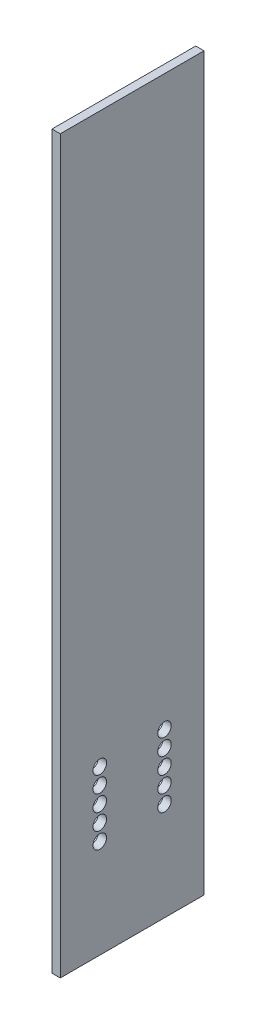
from build123d import *

# Parameters (mm, degrees)
SKETCH1_W                  = 56.4388
SKETCH1_H                  = 287.02
BOSS_EXTRUDE1_DEPTH        = 3.2512
F_4_0_209_DIAMETER_HOLE1_D = 5.3086
LPATTERN1_COUNT            = 4
LPATTERN1_PITCH            = 6.35
LPATTERN1_COL_COUNT        = 2
LPATTERN1_COL_PITCH        = 6.35


with BuildPart() as part:
    # Sketch1 → Boss-Extrude1 (new body)
    with BuildSketch(Plane(origin=(0, 0, 0), x_dir=(0, 0, -1), z_dir=(1, 0, 0))):
        Rectangle(SKETCH1_W, SKETCH1_H)
    extrude(amount=BOSS_EXTRUDE1_DEPTH)

    # 4 _0.209_ Diameter Hole1 (through all)
    with Locations(Plane.ZY):
        with Locations((-12.7, -98.5012), (12.7, -98.5012)):
            f_4_0_209_diameter_hole1 = Hole(F_4_0_209_DIAMETER_HOLE1_D / 2)

    # LPattern1: 4 _0.209_ Diameter Hole1 ×4
    with Locations(*[(0, i * LPATTERN1_PITCH, 0) for i in range(1, LPATTERN1_COUNT)]):
        add(f_4_0_209_diameter_hole1, mode=Mode.SUBTRACT)

    # LPattern1 col: 4 _0.209_ Diameter Hole1 ×2
    with Locations(*[(0, -i * LPATTERN1_COL_PITCH, 0) for i in range(1, LPATTERN1_COL_COUNT)]):
        add(f_4_0_209_diameter_hole1, mode=Mode.SUBTRACT)


solid = part.part
